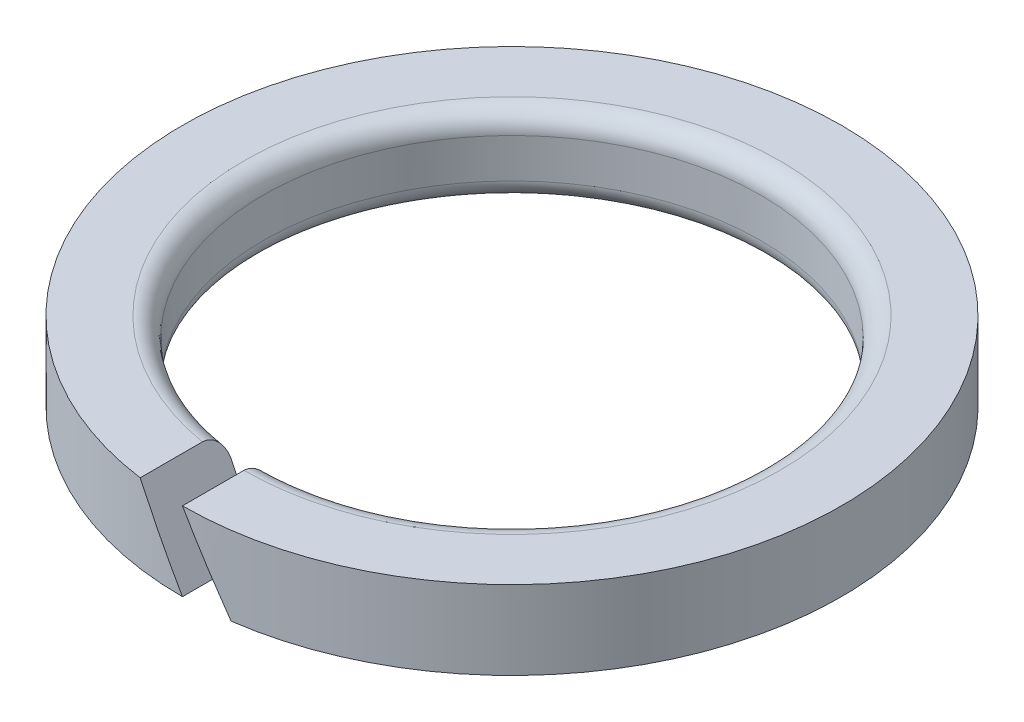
from build123d import *

# Parameters (mm, degrees)
BODYSKE_R      = 33.5
BODYSKE_R_2    = 25.25
BASEBODY_DEPTH = 8
SLIT_DEPTH     = 49.046852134
FILLET1_R      = 2


with BuildPart() as part:
    # BodySke → BaseBody (new body)
    with BuildSketch(Plane(origin=(0, 0, 0), x_dir=(1, 0, 0), z_dir=(0, 1, 0))):
        with Locations(Location((0, 0, 0), (0, 0, 270))):
            Circle(BODYSKE_R)
        with Locations(Location((0, 0, 0), (0, 0, 270))):
            Circle(BODYSKE_R_2, mode=Mode.SUBTRACT)
    extrude(amount=BASEBODY_DEPTH)

    # SlitSke → Slit (cut, through all)
    with BuildSketch(Plane.XY):
        Polygon((0, 0), (-4.618802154, 8), (0, 8), (4.618802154, 0), align=None)
    extrude(amount=SLIT_DEPTH, mode=Mode.SUBTRACT)

    # Fillet1
    fillet1_edges = [part.edges().sort_by_distance(p)[0] for p in [
        (-2.319204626, 0, -25.143265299),
        (2.319204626, 8, -25.143265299),
    ]]
    fillet(fillet1_edges, radius=FILLET1_R)


solid = part.part
